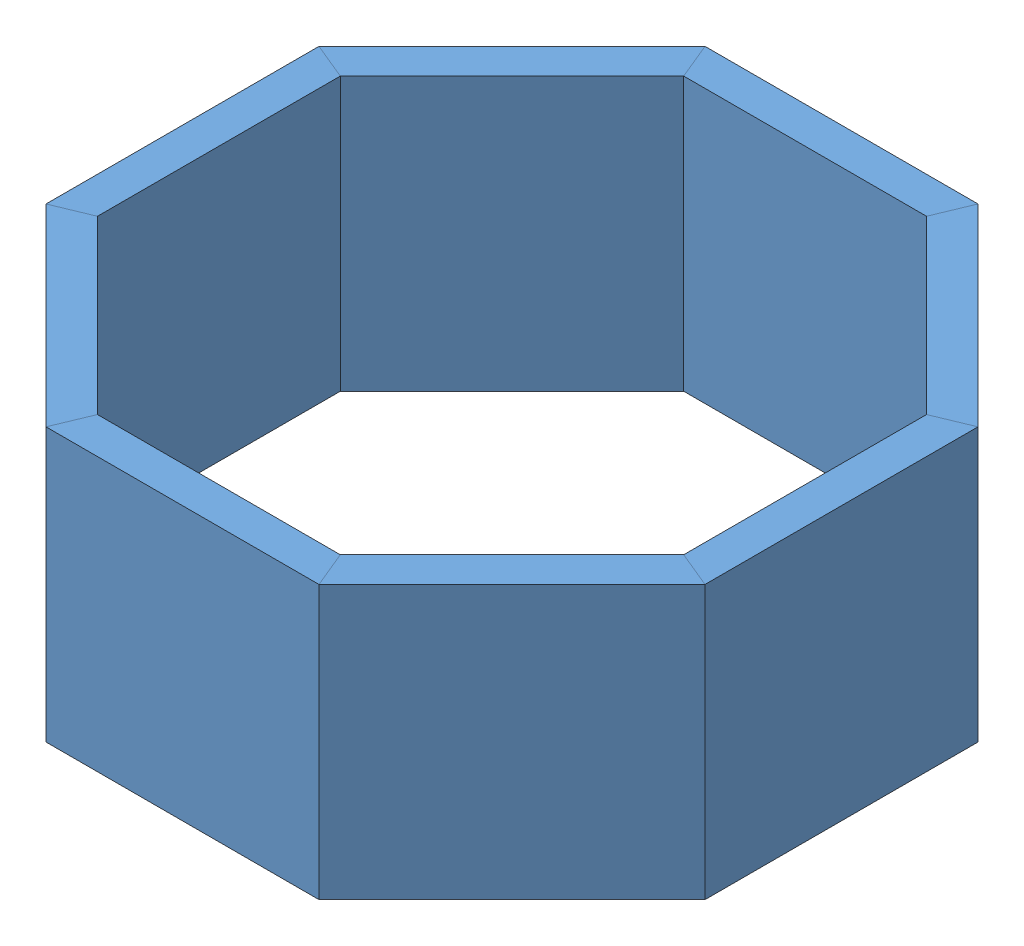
SolidWorks assembly Saule-Unten_ak.SLDASM, configuration Standard (file format 6000). Lengths in mm.
Overall size (72.43 30 72.43).
8 component instances, 1 part files, 3 mates.
Components (placement in the parent):
- Untere-Platte-9: Untere-Platte.SLDPRT [Standard] at (0 0 32.2132) size (30 30 4)
- Untere-Platte-18: Untere-Platte.SLDPRT [Standard] at (-22.7782 0 22.7782) x (0.707107 0 0.707107) z (-0.707107 0 0.707107) size (30 30 4)
- Untere-Platte-19: Untere-Platte.SLDPRT [Standard] at (-32.2132 0 0) x (0 0 1) z (-1 0 0) size (30 30 4)
- Untere-Platte-20: Untere-Platte.SLDPRT [Standard] at (-22.7782 0 -22.7782) x (-0.707107 0 0.707107) z (-0.707107 0 -0.707107) size (30 30 4)
- Untere-Platte-21: Untere-Platte.SLDPRT [Standard] at (0 0 -32.2132) x (-1 0 0) z (0 0 -1) size (30 30 4)
- Untere-Platte-22: Untere-Platte.SLDPRT [Standard] at (22.7782 0 -22.7782) x (-0.707107 0 -0.707107) z (0.707107 0 -0.707107) size (30 30 4)
- Untere-Platte-23: Untere-Platte.SLDPRT [Standard] at (32.2132 0 0) x (0 0 -1) z (1 0 0) size (30 30 4)
- Untere-Platte-24: Untere-Platte.SLDPRT [Standard] at (22.7782 0 22.7782) x (0.707107 0 -0.707107) z (0.707107 0 0.707107) size (30 30 4)
Mates (geometry in assembly coordinates):
- Deckungsgleich2: coincident: plane of Untere-Platte-9 through (0 0 32.43) normal (1 0 0); plane of assembly through (0 0 0) normal (1 0 0)
- Deckungsgleich3: coincident: plane of Untere-Platte-9 through (0 0 32.43) normal (0 1 0); plane of assembly through (0 0 0) normal (0 1 0)
- Deckungsgleich4: coincident aligned: line of Untere-Platte-9 through (-15 0 36.2132) axis (1 0 0); line of assembly
